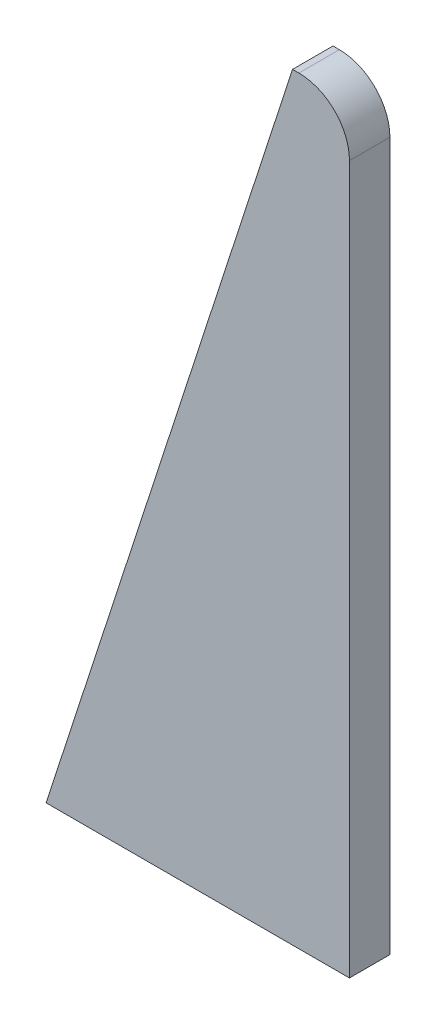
ISO-10303-21;
HEADER;
FILE_DESCRIPTION(('STEP AP214'),'2;1');
FILE_NAME('part.step','',(''),(''),'','','');
FILE_SCHEMA(('AUTOMOTIVE_DESIGN { 1 0 10303 214 1 1 1 1 }'));
ENDSEC;
DATA;
#1=APPLICATION_CONTEXT('core data for automotive mechanical design processes');
#2=APPLICATION_PROTOCOL_DEFINITION('international standard','automotive_design',2000,#1);
#3=PRODUCT_CONTEXT('',#1,'mechanical');
#4=PRODUCT('Part','Part','',(#3));
#5=PRODUCT_RELATED_PRODUCT_CATEGORY('part','',(#4));
#6=PRODUCT_DEFINITION_FORMATION('','',#4);
#7=PRODUCT_DEFINITION_CONTEXT('part definition',#1,'design');
#8=PRODUCT_DEFINITION('design','',#6,#7);
#9=PRODUCT_DEFINITION_SHAPE('','',#8);
#10=(LENGTH_UNIT() NAMED_UNIT(*) SI_UNIT(.MILLI.,.METRE.));
#11=(NAMED_UNIT(*) PLANE_ANGLE_UNIT() SI_UNIT($,.RADIAN.));
#12=(NAMED_UNIT(*) SI_UNIT($,.STERADIAN.) SOLID_ANGLE_UNIT());
#13=UNCERTAINTY_MEASURE_WITH_UNIT(LENGTH_MEASURE(1.E-05),#10,'distance_accuracy_value','');
#14=(GEOMETRIC_REPRESENTATION_CONTEXT(3) GLOBAL_UNCERTAINTY_ASSIGNED_CONTEXT((#13)) GLOBAL_UNIT_ASSIGNED_CONTEXT((#10,
#11,#12)) REPRESENTATION_CONTEXT('',''));
#15=CARTESIAN_POINT('',(0.,0.,0.));
#16=DIRECTION('',(0.,0.,1.));
#17=DIRECTION('',(1.,0.,0.));
#18=AXIS2_PLACEMENT_3D('',#15,#16,#17);
#19=CARTESIAN_POINT('',(48.7379544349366,150.,8.));
#20=DIRECTION('',(0.951056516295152,-0.309016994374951,0.));
#21=DIRECTION('',(0.309016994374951,0.951056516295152,0.));
#22=AXIS2_PLACEMENT_3D('',#19,#20,#21);
#23=PLANE('',#22);
#24=CARTESIAN_POINT('',(10.8155948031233,33.2869780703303,4.));
#25=DIRECTION('',(-0.951056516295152,0.309016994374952,0.));
#26=DIRECTION('',(-0.309016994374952,-0.951056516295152,0.));
#27=AXIS2_PLACEMENT_3D('',#24,#25,#26);
#28=CIRCLE('',#27,2.1);
#29=CARTESIAN_POINT('',(10.1666591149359,31.2897593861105,4.));
#30=VERTEX_POINT('',#29);
#31=EDGE_CURVE('E130',#30,#30,#28,.T.);
#32=ORIENTED_EDGE('',*,*,#31,.F.);
#33=EDGE_LOOP('',(#32));
#34=FACE_BOUND('',#33,.T.);
#35=CARTESIAN_POINT('',(33.9918693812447,104.616216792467,4.));
#36=DIRECTION('',(-0.951056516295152,0.309016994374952,0.));
#37=DIRECTION('',(-0.309016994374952,-0.951056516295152,0.));
#38=AXIS2_PLACEMENT_3D('',#35,#36,#37);
#39=CIRCLE('',#38,2.1);
#40=CARTESIAN_POINT('',(33.3429336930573,102.618998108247,4.));
#41=VERTEX_POINT('',#40);
#42=EDGE_CURVE('E138',#41,#41,#39,.T.);
#43=ORIENTED_EDGE('',*,*,#42,.F.);
#44=EDGE_LOOP('',(#43));
#45=FACE_BOUND('',#44,.T.);
#46=DIRECTION('',(-0.309016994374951,-0.951056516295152,0.));
#47=VECTOR('',#46,1.);
#48=CARTESIAN_POINT('',(48.7379544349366,150.,0.));
#49=LINE('',#48,#47);
#50=CARTESIAN_POINT('',(48.7379544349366,150.,0.));
#51=VERTEX_POINT('',#50);
#52=CARTESIAN_POINT('',(0.,0.,0.));
#53=VERTEX_POINT('',#52);
#54=EDGE_CURVE('E145',#51,#53,#49,.T.);
#55=ORIENTED_EDGE('',*,*,#54,.T.);
#56=DIRECTION('',(0.,0.,-1.));
#57=VECTOR('',#56,1.);
#58=CARTESIAN_POINT('',(0.,0.,8.));
#59=LINE('',#58,#57);
#60=CARTESIAN_POINT('',(0.,0.,8.));
#61=VERTEX_POINT('',#60);
#62=EDGE_CURVE('E174',#61,#53,#59,.T.);
#63=ORIENTED_EDGE('',*,*,#62,.F.);
#64=DIRECTION('',(-0.309016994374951,-0.951056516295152,0.));
#65=VECTOR('',#64,1.);
#66=CARTESIAN_POINT('',(48.7379544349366,150.,8.));
#67=LINE('',#66,#65);
#68=CARTESIAN_POINT('',(48.7379544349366,150.,8.));
#69=VERTEX_POINT('',#68);
#70=EDGE_CURVE('E146',#69,#61,#67,.T.);
#71=ORIENTED_EDGE('',*,*,#70,.F.);
#72=DIRECTION('',(0.,0.,-1.));
#73=VECTOR('',#72,1.);
#74=CARTESIAN_POINT('',(48.7379544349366,150.,8.));
#75=LINE('',#74,#73);
#76=EDGE_CURVE('E159',#69,#51,#75,.T.);
#77=ORIENTED_EDGE('',*,*,#76,.T.);
#78=EDGE_LOOP('',(#55,#63,#71,#77));
#79=FACE_BOUND('',#78,.T.);
#80=ADVANCED_FACE('F44',(#34,#45,#79),#23,.F.);
#81=CARTESIAN_POINT('',(0.,0.,8.));
#82=DIRECTION('',(0.,1.,0.));
#83=DIRECTION('',(0.,0.,1.));
#84=AXIS2_PLACEMENT_3D('',#81,#82,#83);
#85=PLANE('',#84);
#86=CARTESIAN_POINT('',(22.5,0.,4.));
#87=DIRECTION('',(0.,-1.,0.));
#88=DIRECTION('',(0.,0.,-1.));
#89=AXIS2_PLACEMENT_3D('',#86,#87,#88);
#90=CIRCLE('',#89,2.09999999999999);
#91=CARTESIAN_POINT('',(22.5,0.,1.90000000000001));
#92=VERTEX_POINT('',#91);
#93=EDGE_CURVE('E117',#92,#92,#90,.T.);
#94=ORIENTED_EDGE('',*,*,#93,.F.);
#95=EDGE_LOOP('',(#94));
#96=FACE_BOUND('',#95,.T.);
#97=CARTESIAN_POINT('',(52.5,0.,4.00000000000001));
#98=DIRECTION('',(0.,-1.,0.));
#99=DIRECTION('',(0.,0.,-1.));
#100=AXIS2_PLACEMENT_3D('',#97,#98,#99);
#101=CIRCLE('',#100,2.09999999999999);
#102=CARTESIAN_POINT('',(52.5,0.,1.90000000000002));
#103=VERTEX_POINT('',#102);
#104=EDGE_CURVE('E116',#103,#103,#101,.T.);
#105=ORIENTED_EDGE('',*,*,#104,.F.);
#106=EDGE_LOOP('',(#105));
#107=FACE_BOUND('',#106,.T.);
#108=DIRECTION('',(1.,0.,0.));
#109=VECTOR('',#108,1.);
#110=CARTESIAN_POINT('',(0.,0.,0.));
#111=LINE('',#110,#109);
#112=CARTESIAN_POINT('',(60.,0.,0.));
#113=VERTEX_POINT('',#112);
#114=EDGE_CURVE('E163',#53,#113,#111,.T.);
#115=ORIENTED_EDGE('',*,*,#114,.T.);
#116=DIRECTION('',(0.,0.,-1.));
#117=VECTOR('',#116,1.);
#118=CARTESIAN_POINT('',(60.,0.,8.));
#119=LINE('',#118,#117);
#120=CARTESIAN_POINT('',(60.,0.,8.));
#121=VERTEX_POINT('',#120);
#122=EDGE_CURVE('E171',#121,#113,#119,.T.);
#123=ORIENTED_EDGE('',*,*,#122,.F.);
#124=DIRECTION('',(1.,0.,0.));
#125=VECTOR('',#124,1.);
#126=CARTESIAN_POINT('',(0.,0.,8.));
#127=LINE('',#126,#125);
#128=EDGE_CURVE('E150',#61,#121,#127,.T.);
#129=ORIENTED_EDGE('',*,*,#128,.F.);
#130=ORIENTED_EDGE('',*,*,#62,.T.);
#131=EDGE_LOOP('',(#115,#123,#129,#130));
#132=FACE_BOUND('',#131,.T.);
#133=ADVANCED_FACE('F201',(#96,#107,#132),#85,.F.);
#134=CARTESIAN_POINT('',(60.,0.,8.));
#135=DIRECTION('',(-1.,0.,0.));
#136=DIRECTION('',(0.,0.,1.));
#137=AXIS2_PLACEMENT_3D('',#134,#135,#136);
#138=PLANE('',#137);
#139=DIRECTION('',(0.,1.,0.));
#140=VECTOR('',#139,1.);
#141=CARTESIAN_POINT('',(60.,0.,0.));
#142=LINE('',#141,#140);
#143=CARTESIAN_POINT('',(60.,140.,0.));
#144=VERTEX_POINT('',#143);
#145=EDGE_CURVE('E165',#113,#144,#142,.T.);
#146=ORIENTED_EDGE('',*,*,#145,.T.);
#147=DIRECTION('',(0.,0.,-1.));
#148=VECTOR('',#147,1.);
#149=CARTESIAN_POINT('',(60.,140.,8.));
#150=LINE('',#149,#148);
#151=CARTESIAN_POINT('',(60.,140.,8.));
#152=VERTEX_POINT('',#151);
#153=EDGE_CURVE('E52',#144,#152,#150,.F.);
#154=ORIENTED_EDGE('',*,*,#153,.T.);
#155=DIRECTION('',(0.,1.,0.));
#156=VECTOR('',#155,1.);
#157=CARTESIAN_POINT('',(60.,0.,8.));
#158=LINE('',#157,#156);
#159=EDGE_CURVE('E154',#121,#152,#158,.T.);
#160=ORIENTED_EDGE('',*,*,#159,.F.);
#161=ORIENTED_EDGE('',*,*,#122,.T.);
#162=EDGE_LOOP('',(#146,#154,#160,#161));
#163=FACE_BOUND('',#162,.T.);
#164=ADVANCED_FACE('F206',(#163),#138,.F.);
#165=CARTESIAN_POINT('',(48.7379544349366,150.,8.));
#166=DIRECTION('',(0.,-1.,0.));
#167=DIRECTION('',(0.,0.,-1.));
#168=AXIS2_PLACEMENT_3D('',#165,#166,#167);
#169=PLANE('',#168);
#170=DIRECTION('',(-1.,0.,0.));
#171=VECTOR('',#170,1.);
#172=CARTESIAN_POINT('',(48.7379544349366,150.,8.));
#173=LINE('',#172,#171);
#174=CARTESIAN_POINT('',(50.,150.,8.));
#175=VERTEX_POINT('',#174);
#176=EDGE_CURVE('E157',#175,#69,#173,.T.);
#177=ORIENTED_EDGE('',*,*,#176,.F.);
#178=DIRECTION('',(0.,0.,-1.));
#179=VECTOR('',#178,1.);
#180=CARTESIAN_POINT('',(50.,150.,8.));
#181=LINE('',#180,#179);
#182=CARTESIAN_POINT('',(50.,150.,0.));
#183=VERTEX_POINT('',#182);
#184=EDGE_CURVE('E177',#175,#183,#181,.T.);
#185=ORIENTED_EDGE('',*,*,#184,.T.);
#186=DIRECTION('',(-1.,0.,0.));
#187=VECTOR('',#186,1.);
#188=CARTESIAN_POINT('',(48.7379544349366,150.,0.));
#189=LINE('',#188,#187);
#190=EDGE_CURVE('E151',#183,#51,#189,.T.);
#191=ORIENTED_EDGE('',*,*,#190,.T.);
#192=ORIENTED_EDGE('',*,*,#76,.F.);
#193=EDGE_LOOP('',(#177,#185,#191,#192));
#194=FACE_BOUND('',#193,.T.);
#195=ADVANCED_FACE('F183',(#194),#169,.F.);
#196=CARTESIAN_POINT('',(0.,0.,8.));
#197=DIRECTION('',(0.,0.,1.));
#198=DIRECTION('',(1.,0.,0.));
#199=AXIS2_PLACEMENT_3D('',#196,#197,#198);
#200=PLANE('',#199);
#201=ORIENTED_EDGE('',*,*,#159,.T.);
#202=CARTESIAN_POINT('',(50.,140.,8.));
#203=DIRECTION('',(0.,0.,1.));
#204=DIRECTION('',(1.,0.,0.));
#205=AXIS2_PLACEMENT_3D('',#202,#203,#204);
#206=CIRCLE('',#205,10.);
#207=EDGE_CURVE('E11',#152,#175,#206,.T.);
#208=ORIENTED_EDGE('',*,*,#207,.T.);
#209=ORIENTED_EDGE('',*,*,#176,.T.);
#210=ORIENTED_EDGE('',*,*,#70,.T.);
#211=ORIENTED_EDGE('',*,*,#128,.T.);
#212=EDGE_LOOP('',(#201,#208,#209,#210,#211));
#213=FACE_BOUND('',#212,.T.);
#214=ADVANCED_FACE('F193',(#213),#200,.T.);
#215=CARTESIAN_POINT('',(0.,0.,0.));
#216=DIRECTION('',(0.,0.,1.));
#217=DIRECTION('',(1.,0.,0.));
#218=AXIS2_PLACEMENT_3D('',#215,#216,#217);
#219=PLANE('',#218);
#220=ORIENTED_EDGE('',*,*,#190,.F.);
#221=CARTESIAN_POINT('',(50.,140.,0.));
#222=DIRECTION('',(0.,0.,1.));
#223=DIRECTION('',(1.,0.,0.));
#224=AXIS2_PLACEMENT_3D('',#221,#222,#223);
#225=CIRCLE('',#224,10.);
#226=EDGE_CURVE('E66',#183,#144,#225,.F.);
#227=ORIENTED_EDGE('',*,*,#226,.T.);
#228=ORIENTED_EDGE('',*,*,#145,.F.);
#229=ORIENTED_EDGE('',*,*,#114,.F.);
#230=ORIENTED_EDGE('',*,*,#54,.F.);
#231=EDGE_LOOP('',(#220,#227,#228,#229,#230));
#232=FACE_BOUND('',#231,.T.);
#233=ADVANCED_FACE('F188',(#232),#219,.F.);
#234=CARTESIAN_POINT('',(47.3066606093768,100.289978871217,4.));
#235=DIRECTION('',(-0.951056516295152,0.309016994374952,0.));
#236=DIRECTION('',(-0.309016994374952,-0.951056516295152,0.));
#237=AXIS2_PLACEMENT_3D('',#234,#235,#236);
#238=CONICAL_SURFACE('',#237,2.1,1.02974425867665);
#239=CARTESIAN_POINT('',(48.5067106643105,99.9000589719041,4.));
#240=VERTEX_POINT('',#239);
#241=VERTEX_LOOP('',#240);
#242=FACE_BOUND('',#241,.T.);
#243=CARTESIAN_POINT('',(47.3066606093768,100.289978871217,4.));
#244=DIRECTION('',(-0.951056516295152,0.309016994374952,0.));
#245=DIRECTION('',(-0.309016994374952,-0.951056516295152,0.));
#246=AXIS2_PLACEMENT_3D('',#243,#244,#245);
#247=CIRCLE('',#246,2.1);
#248=CARTESIAN_POINT('',(46.6577249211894,98.2927601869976,4.));
#249=VERTEX_POINT('',#248);
#250=EDGE_CURVE('E142',#249,#249,#247,.T.);
#251=ORIENTED_EDGE('',*,*,#250,.T.);
#252=EDGE_LOOP('',(#251));
#253=FACE_BOUND('',#252,.T.);
#254=ADVANCED_FACE('F218',(#242,#253),#238,.F.);
#255=CARTESIAN_POINT('',(33.9918693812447,104.616216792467,4.));
#256=DIRECTION('',(-0.951056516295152,0.309016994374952,0.));
#257=DIRECTION('',(-0.309016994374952,-0.951056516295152,0.));
#258=AXIS2_PLACEMENT_3D('',#255,#256,#257);
#259=CYLINDRICAL_SURFACE('',#258,2.1);
#260=CARTESIAN_POINT('',(46.6577249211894,98.2927601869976,4.));
#261=CARTESIAN_POINT('',(46.5190291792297,98.337825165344,4.));
#262=CARTESIAN_POINT('',(46.38033343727,98.3828901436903,4.));
#263=CARTESIAN_POINT('',(46.1029419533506,98.473020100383,4.));
#264=CARTESIAN_POINT('',(45.9642462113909,98.5180850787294,4.));
#265=CARTESIAN_POINT('',(45.6868547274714,98.6082150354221,4.));
#266=CARTESIAN_POINT('',(45.5481589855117,98.6532800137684,4.));
#267=CARTESIAN_POINT('',(45.2707675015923,98.7434099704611,4.));
#268=CARTESIAN_POINT('',(45.1320717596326,98.7884749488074,4.));
#269=CARTESIAN_POINT('',(44.8546802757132,98.8786049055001,4.));
#270=CARTESIAN_POINT('',(44.7159845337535,98.9236698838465,4.));
#271=CARTESIAN_POINT('',(44.4385930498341,99.0137998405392,4.));
#272=CARTESIAN_POINT('',(44.2998973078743,99.0588648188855,4.));
#273=CARTESIAN_POINT('',(44.0225058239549,99.1489947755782,4.));
#274=CARTESIAN_POINT('',(43.8838100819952,99.1940597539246,4.));
#275=CARTESIAN_POINT('',(43.6064185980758,99.2841897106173,4.));
#276=CARTESIAN_POINT('',(43.4677228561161,99.3292546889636,4.));
#277=CARTESIAN_POINT('',(43.1903313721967,99.4193846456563,4.));
#278=CARTESIAN_POINT('',(43.051635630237,99.4644496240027,4.));
#279=CARTESIAN_POINT('',(42.7742441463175,99.5545795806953,4.));
#280=CARTESIAN_POINT('',(42.6355484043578,99.5996445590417,4.));
#281=CARTESIAN_POINT('',(42.3581569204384,99.6897745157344,4.));
#282=CARTESIAN_POINT('',(42.2194611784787,99.7348394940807,4.));
#283=CARTESIAN_POINT('',(41.9420696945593,99.8249694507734,4.));
#284=CARTESIAN_POINT('',(41.8033739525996,99.8700344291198,4.));
#285=CARTESIAN_POINT('',(41.5259824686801,99.9601643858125,4.));
#286=CARTESIAN_POINT('',(41.3872867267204,100.005229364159,4.));
#287=CARTESIAN_POINT('',(41.109895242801,100.095359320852,4.));
#288=CARTESIAN_POINT('',(40.9711995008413,100.140424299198,4.));
#289=CARTESIAN_POINT('',(40.6938080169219,100.230554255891,4.));
#290=CARTESIAN_POINT('',(40.5551122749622,100.275619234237,4.));
#291=CARTESIAN_POINT('',(40.2777207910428,100.36574919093,4.));
#292=CARTESIAN_POINT('',(40.1390250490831,100.410814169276,4.));
#293=CARTESIAN_POINT('',(39.8616335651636,100.500944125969,4.));
#294=CARTESIAN_POINT('',(39.7229378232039,100.546009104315,4.));
#295=CARTESIAN_POINT('',(39.4455463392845,100.636139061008,4.));
#296=CARTESIAN_POINT('',(39.3068505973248,100.681204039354,4.));
#297=CARTESIAN_POINT('',(39.0294591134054,100.771333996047,4.));
#298=CARTESIAN_POINT('',(38.8907633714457,100.816398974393,4.));
#299=CARTESIAN_POINT('',(38.6133718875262,100.906528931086,4.));
#300=CARTESIAN_POINT('',(38.4746761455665,100.951593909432,4.));
#301=CARTESIAN_POINT('',(38.1972846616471,101.041723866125,4.));
#302=CARTESIAN_POINT('',(38.0585889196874,101.086788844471,4.));
#303=CARTESIAN_POINT('',(37.781197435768,101.176918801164,4.));
#304=CARTESIAN_POINT('',(37.6425016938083,101.22198377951,4.));
#305=CARTESIAN_POINT('',(37.3651102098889,101.312113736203,4.));
#306=CARTESIAN_POINT('',(37.2264144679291,101.357178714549,4.));
#307=CARTESIAN_POINT('',(36.9490229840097,101.447308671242,4.));
#308=CARTESIAN_POINT('',(36.81032724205,101.492373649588,4.));
#309=CARTESIAN_POINT('',(36.5329357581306,101.582503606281,4.));
#310=CARTESIAN_POINT('',(36.3942400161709,101.627568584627,4.));
#311=CARTESIAN_POINT('',(36.1168485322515,101.71769854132,4.));
#312=CARTESIAN_POINT('',(35.9781527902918,101.762763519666,4.));
#313=CARTESIAN_POINT('',(35.7007613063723,101.852893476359,4.));
#314=CARTESIAN_POINT('',(35.5620655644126,101.897958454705,4.));
#315=CARTESIAN_POINT('',(35.2846740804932,101.988088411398,4.));
#316=CARTESIAN_POINT('',(35.1459783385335,102.033153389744,4.));
#317=CARTESIAN_POINT('',(34.8685868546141,102.123283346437,4.));
#318=CARTESIAN_POINT('',(34.7298911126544,102.168348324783,4.));
#319=CARTESIAN_POINT('',(34.4524996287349,102.258478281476,4.));
#320=CARTESIAN_POINT('',(34.3138038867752,102.303543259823,4.));
#321=CARTESIAN_POINT('',(34.0364124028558,102.393673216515,4.));
#322=CARTESIAN_POINT('',(33.8977166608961,102.438738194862,4.));
#323=CARTESIAN_POINT('',(33.6203251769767,102.528868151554,4.));
#324=CARTESIAN_POINT('',(33.481629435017,102.573933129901,4.));
#325=CARTESIAN_POINT('',(33.3429336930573,102.618998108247,4.));
#326=B_SPLINE_CURVE_WITH_KNOTS('',3,(#260,#261,#262,#263,#264,#265,#266,#267,#268,#269,#270,
#271,#272,#273,#274,#275,#276,#277,#278,#279,#280,#281,#282,#283,#284,#285,#286,#287,#288,#289,
#290,#291,#292,#293,#294,#295,#296,#297,#298,#299,#300,#301,#302,#303,#304,#305,#306,#307,#308,
#309,#310,#311,#312,#313,#314,#315,#316,#317,#318,#319,#320,#321,#322,#323,#324,#325),
.UNSPECIFIED.,.F.,.F.,(4,2,2,2,2,2,2,2,2,2,2,2,2,2,2,2,2,2,2,2,2,2,2,2,2,2,2,2,2,2,2,2,4),(0.,
0.4375,0.875000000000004,1.3125,1.75,2.1875,2.625,3.0625,3.5,3.9375,4.37500000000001,4.8125,
5.25,5.68750000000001,6.12500000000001,6.5625,7.,7.4375,7.87500000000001,8.31250000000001,
8.75000000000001,9.18750000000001,9.625,10.0625,10.5,10.9375,11.375,11.8125,12.25,12.6875,
13.125,13.5625,14.),.UNSPECIFIED.);
#327=EDGE_CURVE('BSEAM223',#249,#41,#326,.T.);
#328=ORIENTED_EDGE('',*,*,#250,.F.);
#329=ORIENTED_EDGE('',*,*,#42,.T.);
#330=ORIENTED_EDGE('',*,*,#327,.T.);
#331=ORIENTED_EDGE('',*,*,#327,.F.);
#332=EDGE_LOOP('',(#328,#330,#329,#331));
#333=FACE_BOUND('',#332,.T.);
#334=ADVANCED_FACE('F223',(#333),#259,.F.);
#335=CARTESIAN_POINT('',(24.1303860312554,28.960740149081,4.));
#336=DIRECTION('',(-0.951056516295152,0.309016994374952,0.));
#337=DIRECTION('',(-0.309016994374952,-0.951056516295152,0.));
#338=AXIS2_PLACEMENT_3D('',#335,#336,#337);
#339=CONICAL_SURFACE('',#338,2.1,1.02974425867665);
#340=CARTESIAN_POINT('',(25.3304360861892,28.5708202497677,4.));
#341=VERTEX_POINT('',#340);
#342=VERTEX_LOOP('',#341);
#343=FACE_BOUND('',#342,.T.);
#344=CARTESIAN_POINT('',(24.1303860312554,28.960740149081,4.));
#345=DIRECTION('',(-0.951056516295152,0.309016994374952,0.));
#346=DIRECTION('',(-0.309016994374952,-0.951056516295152,0.));
#347=AXIS2_PLACEMENT_3D('',#344,#345,#346);
#348=CIRCLE('',#347,2.1);
#349=CARTESIAN_POINT('',(23.481450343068,26.9635214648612,4.));
#350=VERTEX_POINT('',#349);
#351=EDGE_CURVE('E134',#350,#350,#348,.T.);
#352=ORIENTED_EDGE('',*,*,#351,.T.);
#353=EDGE_LOOP('',(#352));
#354=FACE_BOUND('',#353,.T.);
#355=ADVANCED_FACE('F227',(#343,#354),#339,.F.);
#356=CARTESIAN_POINT('',(10.8155948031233,33.2869780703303,4.));
#357=DIRECTION('',(-0.951056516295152,0.309016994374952,0.));
#358=DIRECTION('',(-0.309016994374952,-0.951056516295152,0.));
#359=AXIS2_PLACEMENT_3D('',#356,#357,#358);
#360=CYLINDRICAL_SURFACE('',#359,2.1);
#361=CARTESIAN_POINT('',(23.481450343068,26.9635214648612,4.));
#362=CARTESIAN_POINT('',(23.3427546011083,27.0085864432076,4.));
#363=CARTESIAN_POINT('',(23.2040588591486,27.0536514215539,4.));
#364=CARTESIAN_POINT('',(22.9266673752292,27.1437813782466,4.));
#365=CARTESIAN_POINT('',(22.7879716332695,27.1888463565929,4.));
#366=CARTESIAN_POINT('',(22.5105801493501,27.2789763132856,4.));
#367=CARTESIAN_POINT('',(22.3718844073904,27.324041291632,4.));
#368=CARTESIAN_POINT('',(22.0944929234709,27.4141712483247,4.));
#369=CARTESIAN_POINT('',(21.9557971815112,27.459236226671,4.));
#370=CARTESIAN_POINT('',(21.6784056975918,27.5493661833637,4.));
#371=CARTESIAN_POINT('',(21.5397099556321,27.5944311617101,4.));
#372=CARTESIAN_POINT('',(21.2623184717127,27.6845611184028,4.));
#373=CARTESIAN_POINT('',(21.123622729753,27.7296260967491,4.));
#374=CARTESIAN_POINT('',(20.8462312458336,27.8197560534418,4.));
#375=CARTESIAN_POINT('',(20.7075355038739,27.8648210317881,4.));
#376=CARTESIAN_POINT('',(20.4301440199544,27.9549509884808,4.));
#377=CARTESIAN_POINT('',(20.2914482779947,28.0000159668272,4.));
#378=CARTESIAN_POINT('',(20.0140567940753,28.0901459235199,4.));
#379=CARTESIAN_POINT('',(19.8753610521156,28.1352109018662,4.));
#380=CARTESIAN_POINT('',(19.5979695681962,28.2253408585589,4.));
#381=CARTESIAN_POINT('',(19.4592738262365,28.2704058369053,4.));
#382=CARTESIAN_POINT('',(19.181882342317,28.360535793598,4.));
#383=CARTESIAN_POINT('',(19.0431866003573,28.4056007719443,4.));
#384=CARTESIAN_POINT('',(18.7657951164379,28.495730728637,4.));
#385=CARTESIAN_POINT('',(18.6270993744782,28.5407957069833,4.));
#386=CARTESIAN_POINT('',(18.3497078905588,28.630925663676,4.));
#387=CARTESIAN_POINT('',(18.2110121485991,28.6759906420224,4.));
#388=CARTESIAN_POINT('',(17.9336206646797,28.7661205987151,4.));
#389=CARTESIAN_POINT('',(17.7949249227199,28.8111855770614,4.));
#390=CARTESIAN_POINT('',(17.5175334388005,28.9013155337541,4.));
#391=CARTESIAN_POINT('',(17.3788376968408,28.9463805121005,4.));
#392=CARTESIAN_POINT('',(17.1014462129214,29.0365104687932,4.));
#393=CARTESIAN_POINT('',(16.9627504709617,29.0815754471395,4.));
#394=CARTESIAN_POINT('',(16.6853589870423,29.1717054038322,4.));
#395=CARTESIAN_POINT('',(16.5466632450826,29.2167703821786,4.));
#396=CARTESIAN_POINT('',(16.2692717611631,29.3069003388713,4.));
#397=CARTESIAN_POINT('',(16.1305760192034,29.3519653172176,4.));
#398=CARTESIAN_POINT('',(15.853184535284,29.4420952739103,4.));
#399=CARTESIAN_POINT('',(15.7144887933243,29.4871602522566,4.));
#400=CARTESIAN_POINT('',(15.4370973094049,29.5772902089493,4.));
#401=CARTESIAN_POINT('',(15.2984015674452,29.6223551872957,4.));
#402=CARTESIAN_POINT('',(15.0210100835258,29.7124851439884,4.));
#403=CARTESIAN_POINT('',(14.882314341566,29.7575501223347,4.));
#404=CARTESIAN_POINT('',(14.6049228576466,29.8476800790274,4.));
#405=CARTESIAN_POINT('',(14.4662271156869,29.8927450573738,4.));
#406=CARTESIAN_POINT('',(14.1888356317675,29.9828750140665,4.));
#407=CARTESIAN_POINT('',(14.0501398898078,30.0279399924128,4.));
#408=CARTESIAN_POINT('',(13.7727484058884,30.1180699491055,4.));
#409=CARTESIAN_POINT('',(13.6340526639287,30.1631349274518,4.));
#410=CARTESIAN_POINT('',(13.3566611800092,30.2532648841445,4.));
#411=CARTESIAN_POINT('',(13.2179654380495,30.2983298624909,4.));
#412=CARTESIAN_POINT('',(12.9405739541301,30.3884598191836,4.));
#413=CARTESIAN_POINT('',(12.8018782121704,30.4335247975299,4.));
#414=CARTESIAN_POINT('',(12.524486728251,30.5236547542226,4.));
#415=CARTESIAN_POINT('',(12.3857909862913,30.568719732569,4.));
#416=CARTESIAN_POINT('',(12.1083995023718,30.6588496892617,4.));
#417=CARTESIAN_POINT('',(11.9697037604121,30.703914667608,4.));
#418=CARTESIAN_POINT('',(11.6923122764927,30.7940446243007,4.));
#419=CARTESIAN_POINT('',(11.553616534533,30.839109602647,4.));
#420=CARTESIAN_POINT('',(11.2762250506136,30.9292395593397,4.));
#421=CARTESIAN_POINT('',(11.1375293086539,30.9743045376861,4.));
#422=CARTESIAN_POINT('',(10.8601378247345,31.0644344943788,4.));
#423=CARTESIAN_POINT('',(10.7214420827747,31.1094994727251,4.));
#424=CARTESIAN_POINT('',(10.4440505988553,31.1996294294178,4.));
#425=CARTESIAN_POINT('',(10.3053548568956,31.2446944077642,4.));
#426=CARTESIAN_POINT('',(10.1666591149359,31.2897593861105,4.));
#427=B_SPLINE_CURVE_WITH_KNOTS('',3,(#361,#362,#363,#364,#365,#366,#367,#368,#369,#370,#371,
#372,#373,#374,#375,#376,#377,#378,#379,#380,#381,#382,#383,#384,#385,#386,#387,#388,#389,#390,
#391,#392,#393,#394,#395,#396,#397,#398,#399,#400,#401,#402,#403,#404,#405,#406,#407,#408,#409,
#410,#411,#412,#413,#414,#415,#416,#417,#418,#419,#420,#421,#422,#423,#424,#425,#426),
.UNSPECIFIED.,.F.,.F.,(4,2,2,2,2,2,2,2,2,2,2,2,2,2,2,2,2,2,2,2,2,2,2,2,2,2,2,2,2,2,2,2,4),(0.,
0.437499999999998,0.874999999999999,1.3125,1.75,2.1875,2.625,3.0625,3.5,3.9375,4.375,4.8125,
5.25,5.6875,6.125,6.5625,7.,7.4375,7.875,8.3125,8.75,9.1875,9.625,10.0625,10.5,10.9375,11.375,
11.8125,12.25,12.6875,13.125,13.5625,14.),.UNSPECIFIED.);
#428=EDGE_CURVE('BSEAM231',#350,#30,#427,.T.);
#429=ORIENTED_EDGE('',*,*,#351,.F.);
#430=ORIENTED_EDGE('',*,*,#31,.T.);
#431=ORIENTED_EDGE('',*,*,#428,.T.);
#432=ORIENTED_EDGE('',*,*,#428,.F.);
#433=EDGE_LOOP('',(#429,#431,#430,#432));
#434=FACE_BOUND('',#433,.T.);
#435=ADVANCED_FACE('F231',(#434),#360,.F.);
#436=CARTESIAN_POINT('',(52.5,14.,4.00000000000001));
#437=DIRECTION('',(0.,-1.,0.));
#438=DIRECTION('',(0.,0.,-1.));
#439=AXIS2_PLACEMENT_3D('',#436,#437,#438);
#440=CONICAL_SURFACE('',#439,2.09999999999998,1.02974425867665);
#441=CARTESIAN_POINT('',(52.5,15.2618072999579,4.00000000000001));
#442=VERTEX_POINT('',#441);
#443=VERTEX_LOOP('',#442);
#444=FACE_BOUND('',#443,.T.);
#445=CARTESIAN_POINT('',(52.5,14.,4.00000000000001));
#446=DIRECTION('',(0.,-1.,0.));
#447=DIRECTION('',(0.,0.,-1.));
#448=AXIS2_PLACEMENT_3D('',#445,#446,#447);
#449=CIRCLE('',#448,2.09999999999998);
#450=CARTESIAN_POINT('',(52.5,14.,1.90000000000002));
#451=VERTEX_POINT('',#450);
#452=EDGE_CURVE('E122',#451,#451,#449,.T.);
#453=ORIENTED_EDGE('',*,*,#452,.T.);
#454=EDGE_LOOP('',(#453));
#455=FACE_BOUND('',#454,.T.);
#456=ADVANCED_FACE('F235',(#444,#455),#440,.F.);
#457=CARTESIAN_POINT('',(52.5,0.,4.00000000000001));
#458=DIRECTION('',(0.,-1.,0.));
#459=DIRECTION('',(0.,0.,-1.));
#460=AXIS2_PLACEMENT_3D('',#457,#458,#459);
#461=CYLINDRICAL_SURFACE('',#460,2.09999999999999);
#462=ORIENTED_EDGE('',*,*,#452,.F.);
#463=EDGE_LOOP('',(#462));
#464=FACE_BOUND('',#463,.T.);
#465=ORIENTED_EDGE('',*,*,#104,.T.);
#466=EDGE_LOOP('',(#465));
#467=FACE_BOUND('',#466,.T.);
#468=ADVANCED_FACE('F109',(#464,#467),#461,.F.);
#469=CARTESIAN_POINT('',(22.5,14.,4.));
#470=DIRECTION('',(0.,-1.,0.));
#471=DIRECTION('',(0.,0.,-1.));
#472=AXIS2_PLACEMENT_3D('',#469,#470,#471);
#473=CONICAL_SURFACE('',#472,2.09999999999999,1.02974425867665);
#474=CARTESIAN_POINT('',(22.5,15.2618072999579,4.));
#475=VERTEX_POINT('',#474);
#476=VERTEX_LOOP('',#475);
#477=FACE_BOUND('',#476,.T.);
#478=CARTESIAN_POINT('',(22.5,14.,4.));
#479=DIRECTION('',(0.,-1.,0.));
#480=DIRECTION('',(0.,0.,-1.));
#481=AXIS2_PLACEMENT_3D('',#478,#479,#480);
#482=CIRCLE('',#481,2.09999999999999);
#483=CARTESIAN_POINT('',(22.5,14.,1.90000000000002));
#484=VERTEX_POINT('',#483);
#485=EDGE_CURVE('E113',#484,#484,#482,.T.);
#486=ORIENTED_EDGE('',*,*,#485,.T.);
#487=EDGE_LOOP('',(#486));
#488=FACE_BOUND('',#487,.T.);
#489=ADVANCED_FACE('F105',(#477,#488),#473,.F.);
#490=CARTESIAN_POINT('',(22.5,0.,4.));
#491=DIRECTION('',(0.,-1.,0.));
#492=DIRECTION('',(0.,0.,-1.));
#493=AXIS2_PLACEMENT_3D('',#490,#491,#492);
#494=CYLINDRICAL_SURFACE('',#493,2.09999999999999);
#495=ORIENTED_EDGE('',*,*,#485,.F.);
#496=EDGE_LOOP('',(#495));
#497=FACE_BOUND('',#496,.T.);
#498=ORIENTED_EDGE('',*,*,#93,.T.);
#499=EDGE_LOOP('',(#498));
#500=FACE_BOUND('',#499,.T.);
#501=ADVANCED_FACE('F108',(#497,#500),#494,.F.);
#502=CARTESIAN_POINT('',(50.,140.,8.));
#503=DIRECTION('',(0.,0.,-1.));
#504=DIRECTION('',(-1.,0.,0.));
#505=AXIS2_PLACEMENT_3D('',#502,#503,#504);
#506=CYLINDRICAL_SURFACE('',#505,10.);
#507=ORIENTED_EDGE('',*,*,#207,.F.);
#508=ORIENTED_EDGE('',*,*,#153,.F.);
#509=ORIENTED_EDGE('',*,*,#226,.F.);
#510=ORIENTED_EDGE('',*,*,#184,.F.);
#511=EDGE_LOOP('',(#507,#508,#509,#510));
#512=FACE_BOUND('',#511,.T.);
#513=ADVANCED_FACE('F46',(#512),#506,.T.);
#514=CLOSED_SHELL('',(#80,#133,#164,#195,#214,#233,#254,#334,#355,#435,#456,#468,#489,#501,#513));
#515=MANIFOLD_SOLID_BREP('B2',#514);
#516=ADVANCED_BREP_SHAPE_REPRESENTATION('',(#18,#515),#14);
#517=SHAPE_DEFINITION_REPRESENTATION(#9,#516);
ENDSEC;
END-ISO-10303-21;
